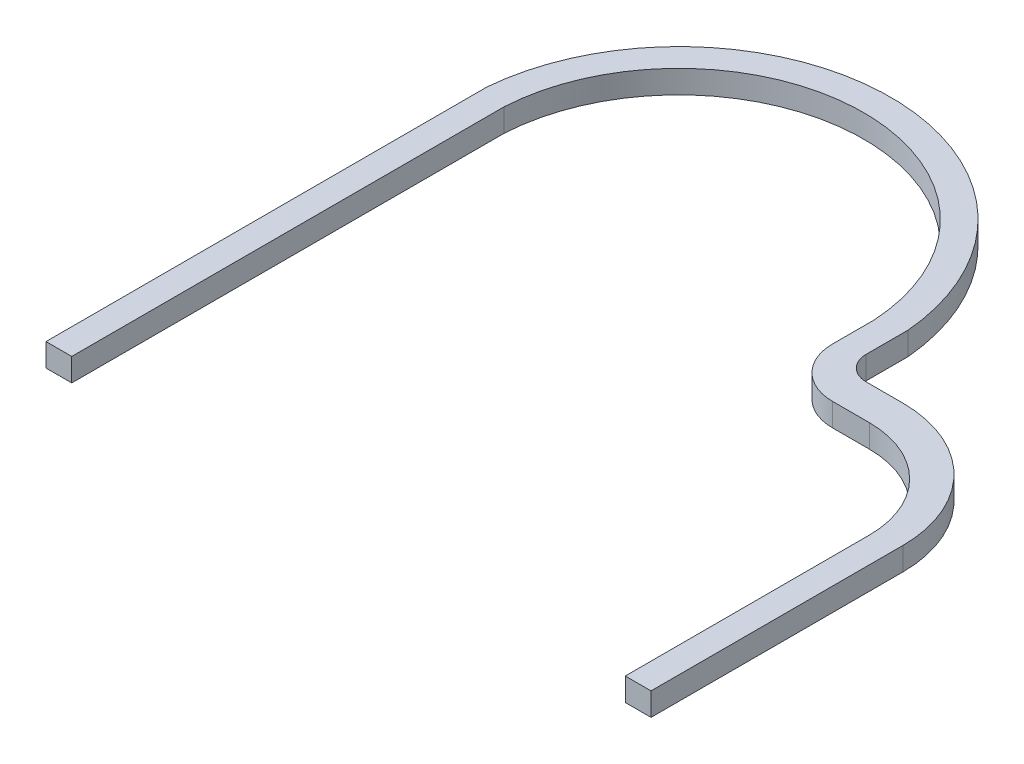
from build123d import *

# Parameters (mm, degrees)
RIM_DEPTH = 3.175


with BuildPart() as part:
    # Sketch2 → rim (new body)
    with BuildSketch(Plane(origin=(0, 0, 0), x_dir=(1, 0, 0), z_dir=(0, 1, 0))):
        with BuildLine():
            ThreePointArc((6.858, -10.16), (1.873543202, 1.873543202), (-10.16, 6.858))
            Line((-10.16, 6.858), (-15.24, 6.858))
            ThreePointArc((-15.24, 6.858), (-17.574866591, 7.825133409), (-18.542, 10.16))
            Line((-18.542, 10.16), (-18.542, 15.953751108))
            ThreePointArc((-18.542, 15.953751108), (-47.625, 42.606368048), (-76.708, 15.953751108))
            Line((-76.708, 15.953751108), (-76.708, -44.958))
            Line((-76.708, -44.958), (-73.152, -44.958))
            Line((-73.152, -44.958), (-73.152, 14.778504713))
            ThreePointArc((-73.152, 14.778504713), (-47.625, 38.902781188), (-22.098, 14.778504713))
            Line((-22.098, 14.778504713), (-22.098, 9.063504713))
            ThreePointArc((-22.098, 9.063504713), (-20.089338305, 4.214166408), (-15.24, 2.205504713))
            Line((-15.24, 2.205504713), (-10.16, 2.205504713))
            ThreePointArc((-10.16, 2.205504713), (-0.640928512, -1.737423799), (3.302, -11.256495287))
            Line((3.302, -11.256495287), (3.302, -44.958))
            Line((3.302, -44.958), (6.858, -44.958))
            Line((6.858, -44.958), (6.858, -10.16))
        make_face()
    extrude(amount=RIM_DEPTH)


solid = part.part
